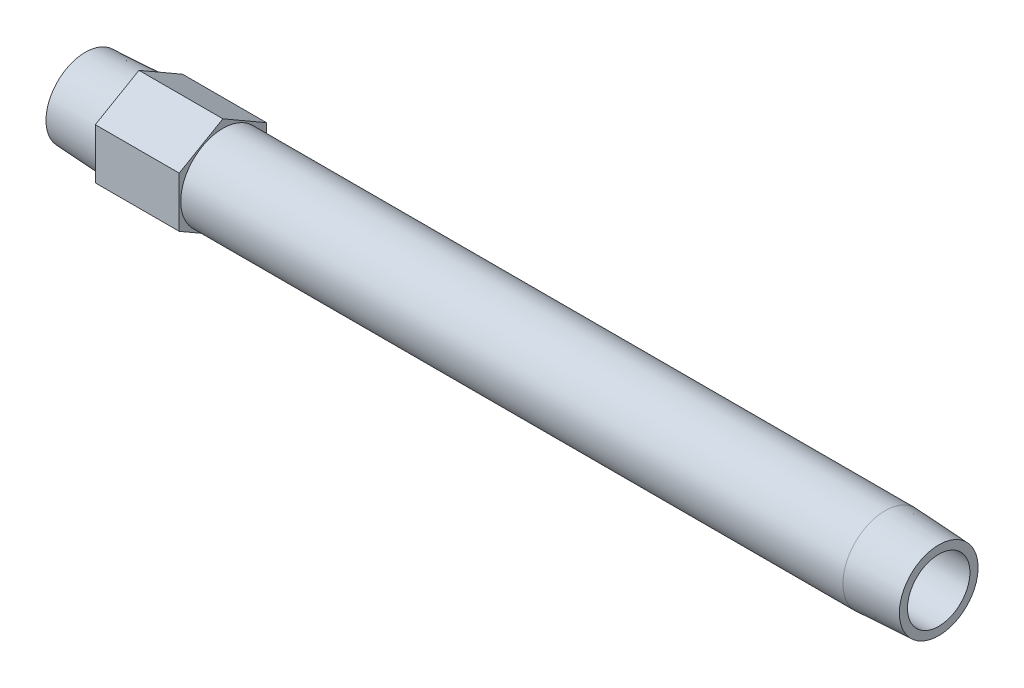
ISO-10303-21;
HEADER;
FILE_DESCRIPTION(('STEP AP214'),'2;1');
FILE_NAME('part.step','',(''),(''),'','','');
FILE_SCHEMA(('AUTOMOTIVE_DESIGN { 1 0 10303 214 1 1 1 1 }'));
ENDSEC;
DATA;
#1=APPLICATION_CONTEXT('core data for automotive mechanical design processes');
#2=APPLICATION_PROTOCOL_DEFINITION('international standard','automotive_design',2000,#1);
#3=PRODUCT_CONTEXT('',#1,'mechanical');
#4=PRODUCT('Part','Part','',(#3));
#5=PRODUCT_RELATED_PRODUCT_CATEGORY('part','',(#4));
#6=PRODUCT_DEFINITION_FORMATION('','',#4);
#7=PRODUCT_DEFINITION_CONTEXT('part definition',#1,'design');
#8=PRODUCT_DEFINITION('design','',#6,#7);
#9=PRODUCT_DEFINITION_SHAPE('','',#8);
#10=(LENGTH_UNIT() NAMED_UNIT(*) SI_UNIT(.MILLI.,.METRE.));
#11=(NAMED_UNIT(*) PLANE_ANGLE_UNIT() SI_UNIT($,.RADIAN.));
#12=(NAMED_UNIT(*) SI_UNIT($,.STERADIAN.) SOLID_ANGLE_UNIT());
#13=UNCERTAINTY_MEASURE_WITH_UNIT(LENGTH_MEASURE(1.E-05),#10,'distance_accuracy_value','');
#14=(GEOMETRIC_REPRESENTATION_CONTEXT(3) GLOBAL_UNCERTAINTY_ASSIGNED_CONTEXT((#13)) GLOBAL_UNIT_ASSIGNED_CONTEXT((#10,
#11,#12)) REPRESENTATION_CONTEXT('',''));
#15=CARTESIAN_POINT('',(0.,0.,0.));
#16=DIRECTION('',(0.,0.,1.));
#17=DIRECTION('',(1.,0.,0.));
#18=AXIS2_PLACEMENT_3D('',#15,#16,#17);
#19=CARTESIAN_POINT('',(0.,0.,-9.95716184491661));
#20=DIRECTION('',(1.,0.,0.));
#21=DIRECTION('',(0.,0.,-1.));
#22=AXIS2_PLACEMENT_3D('',#19,#20,#21);
#23=PLANE('',#22);
#24=CARTESIAN_POINT('',(0.,0.,0.));
#25=DIRECTION('',(-1.,0.,0.));
#26=DIRECTION('',(0.,0.,1.));
#27=AXIS2_PLACEMENT_3D('',#24,#25,#26);
#28=CIRCLE('',#27,9.95716184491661);
#29=CARTESIAN_POINT('',(0.,0.,9.95716184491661));
#30=VERTEX_POINT('',#29);
#31=EDGE_CURVE('E147',#30,#30,#28,.T.);
#32=ORIENTED_EDGE('',*,*,#31,.T.);
#33=EDGE_LOOP('',(#32));
#34=FACE_BOUND('',#33,.T.);
#35=CARTESIAN_POINT('',(0.,0.,0.));
#36=DIRECTION('',(1.,0.,0.));
#37=DIRECTION('',(0.,0.,1.));
#38=AXIS2_PLACEMENT_3D('',#35,#36,#37);
#39=CIRCLE('',#38,7.8994);
#40=CARTESIAN_POINT('',(0.,0.,7.8994));
#41=VERTEX_POINT('',#40);
#42=EDGE_CURVE('E159',#41,#41,#39,.T.);
#43=ORIENTED_EDGE('',*,*,#42,.T.);
#44=EDGE_LOOP('',(#43));
#45=FACE_BOUND('',#44,.T.);
#46=ADVANCED_FACE('F15',(#34,#45),#23,.F.);
#47=CARTESIAN_POINT('',(215.9,0.,-9.95716184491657));
#48=DIRECTION('',(-1.,0.,0.));
#49=DIRECTION('',(0.,0.,1.));
#50=AXIS2_PLACEMENT_3D('',#47,#48,#49);
#51=PLANE('',#50);
#52=CARTESIAN_POINT('',(215.9,0.,0.));
#53=DIRECTION('',(-1.,0.,0.));
#54=DIRECTION('',(0.,0.,1.));
#55=AXIS2_PLACEMENT_3D('',#52,#53,#54);
#56=CIRCLE('',#55,9.95716184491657);
#57=CARTESIAN_POINT('',(215.9,0.,9.95716184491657));
#58=VERTEX_POINT('',#57);
#59=EDGE_CURVE('E150',#58,#58,#56,.T.);
#60=ORIENTED_EDGE('',*,*,#59,.F.);
#61=EDGE_LOOP('',(#60));
#62=FACE_BOUND('',#61,.T.);
#63=CARTESIAN_POINT('',(215.9,0.,0.));
#64=DIRECTION('',(-1.,0.,0.));
#65=DIRECTION('',(0.,0.,1.));
#66=AXIS2_PLACEMENT_3D('',#63,#64,#65);
#67=CIRCLE('',#66,7.8994);
#68=CARTESIAN_POINT('',(215.9,0.,7.8994));
#69=VERTEX_POINT('',#68);
#70=EDGE_CURVE('E156',#69,#69,#67,.F.);
#71=ORIENTED_EDGE('',*,*,#70,.F.);
#72=EDGE_LOOP('',(#71));
#73=FACE_BOUND('',#72,.T.);
#74=ADVANCED_FACE('F178',(#62,#73),#51,.F.);
#75=CARTESIAN_POINT('',(34.798,-6.37914312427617,-11.049));
#76=DIRECTION('',(1.,0.,0.));
#77=DIRECTION('',(0.,1.,0.));
#78=AXIS2_PLACEMENT_3D('',#75,#76,#77);
#79=PLANE('',#78);
#80=DIRECTION('',(0.,0.5,-0.866025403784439));
#81=VECTOR('',#80,1.);
#82=CARTESIAN_POINT('',(34.798,-12.7582862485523,0.));
#83=LINE('',#82,#81);
#84=CARTESIAN_POINT('',(34.798,-12.7582862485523,0.));
#85=VERTEX_POINT('',#84);
#86=CARTESIAN_POINT('',(34.798,-6.37914312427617,-11.049));
#87=VERTEX_POINT('',#86);
#88=EDGE_CURVE('E103',#85,#87,#83,.T.);
#89=ORIENTED_EDGE('',*,*,#88,.T.);
#90=DIRECTION('',(0.,1.,0.));
#91=VECTOR('',#90,1.);
#92=CARTESIAN_POINT('',(34.798,-6.37914312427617,-11.049));
#93=LINE('',#92,#91);
#94=CARTESIAN_POINT('',(34.798,6.37914312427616,-11.049));
#95=VERTEX_POINT('',#94);
#96=EDGE_CURVE('E83',#87,#95,#93,.T.);
#97=ORIENTED_EDGE('',*,*,#96,.T.);
#98=DIRECTION('',(0.,0.5,0.866025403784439));
#99=VECTOR('',#98,1.);
#100=CARTESIAN_POINT('',(34.798,6.37914312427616,-11.049));
#101=LINE('',#100,#99);
#102=CARTESIAN_POINT('',(34.798,12.7582862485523,0.));
#103=VERTEX_POINT('',#102);
#104=EDGE_CURVE('E102',#95,#103,#101,.T.);
#105=ORIENTED_EDGE('',*,*,#104,.T.);
#106=DIRECTION('',(0.,-0.5,0.866025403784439));
#107=VECTOR('',#106,1.);
#108=CARTESIAN_POINT('',(34.798,12.7582862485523,0.));
#109=LINE('',#108,#107);
#110=CARTESIAN_POINT('',(34.798,6.37914312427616,11.049));
#111=VERTEX_POINT('',#110);
#112=EDGE_CURVE('E105',#103,#111,#109,.T.);
#113=ORIENTED_EDGE('',*,*,#112,.T.);
#114=DIRECTION('',(0.,-1.,0.));
#115=VECTOR('',#114,1.);
#116=CARTESIAN_POINT('',(34.798,6.37914312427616,11.049));
#117=LINE('',#116,#115);
#118=CARTESIAN_POINT('',(34.798,-6.37914312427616,11.049));
#119=VERTEX_POINT('',#118);
#120=EDGE_CURVE('E35',#111,#119,#117,.T.);
#121=ORIENTED_EDGE('',*,*,#120,.T.);
#122=DIRECTION('',(0.,-0.5,-0.866025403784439));
#123=VECTOR('',#122,1.);
#124=CARTESIAN_POINT('',(34.798,-6.37914312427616,11.049));
#125=LINE('',#124,#123);
#126=EDGE_CURVE('E30',#119,#85,#125,.T.);
#127=ORIENTED_EDGE('',*,*,#126,.T.);
#128=EDGE_LOOP('',(#89,#97,#105,#113,#121,#127));
#129=FACE_BOUND('',#128,.T.);
#130=CARTESIAN_POINT('',(34.798,0.,0.));
#131=DIRECTION('',(1.,0.,0.));
#132=DIRECTION('',(0.,1.,0.));
#133=AXIS2_PLACEMENT_3D('',#130,#131,#132);
#134=CIRCLE('',#133,10.668);
#135=CARTESIAN_POINT('',(34.798,10.668,0.));
#136=VERTEX_POINT('',#135);
#137=EDGE_CURVE('E89',#136,#136,#134,.F.);
#138=ORIENTED_EDGE('',*,*,#137,.T.);
#139=EDGE_LOOP('',(#138));
#140=FACE_BOUND('',#139,.T.);
#141=ADVANCED_FACE('F124',(#129,#140),#79,.T.);
#142=CARTESIAN_POINT('',(13.5636,-6.37914312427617,-11.049));
#143=DIRECTION('',(1.,0.,0.));
#144=DIRECTION('',(0.,1.,0.));
#145=AXIS2_PLACEMENT_3D('',#142,#143,#144);
#146=PLANE('',#145);
#147=DIRECTION('',(0.,0.5,-0.866025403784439));
#148=VECTOR('',#147,1.);
#149=CARTESIAN_POINT('',(13.5636,-12.7582862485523,0.));
#150=LINE('',#149,#148);
#151=CARTESIAN_POINT('',(13.5636,-12.7582862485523,0.));
#152=VERTEX_POINT('',#151);
#153=CARTESIAN_POINT('',(13.5636,-6.37914312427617,-11.049));
#154=VERTEX_POINT('',#153);
#155=EDGE_CURVE('E73',#152,#154,#150,.T.);
#156=ORIENTED_EDGE('',*,*,#155,.F.);
#157=DIRECTION('',(0.,-0.5,-0.866025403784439));
#158=VECTOR('',#157,1.);
#159=CARTESIAN_POINT('',(13.5636,-6.37914312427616,11.049));
#160=LINE('',#159,#158);
#161=CARTESIAN_POINT('',(13.5636,-6.37914312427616,11.049));
#162=VERTEX_POINT('',#161);
#163=EDGE_CURVE('E99',#162,#152,#160,.T.);
#164=ORIENTED_EDGE('',*,*,#163,.F.);
#165=DIRECTION('',(0.,-1.,0.));
#166=VECTOR('',#165,1.);
#167=CARTESIAN_POINT('',(13.5636,6.37914312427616,11.049));
#168=LINE('',#167,#166);
#169=CARTESIAN_POINT('',(13.5636,6.37914312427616,11.049));
#170=VERTEX_POINT('',#169);
#171=EDGE_CURVE('E133',#170,#162,#168,.T.);
#172=ORIENTED_EDGE('',*,*,#171,.F.);
#173=DIRECTION('',(0.,-0.5,0.866025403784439));
#174=VECTOR('',#173,1.);
#175=CARTESIAN_POINT('',(13.5636,12.7582862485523,0.));
#176=LINE('',#175,#174);
#177=CARTESIAN_POINT('',(13.5636,12.7582862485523,0.));
#178=VERTEX_POINT('',#177);
#179=EDGE_CURVE('E129',#178,#170,#176,.T.);
#180=ORIENTED_EDGE('',*,*,#179,.F.);
#181=DIRECTION('',(0.,0.5,0.866025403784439));
#182=VECTOR('',#181,1.);
#183=CARTESIAN_POINT('',(13.5636,6.37914312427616,-11.049));
#184=LINE('',#183,#182);
#185=CARTESIAN_POINT('',(13.5636,6.37914312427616,-11.049));
#186=VERTEX_POINT('',#185);
#187=EDGE_CURVE('E75',#186,#178,#184,.T.);
#188=ORIENTED_EDGE('',*,*,#187,.F.);
#189=DIRECTION('',(0.,1.,0.));
#190=VECTOR('',#189,1.);
#191=CARTESIAN_POINT('',(13.5636,-6.37914312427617,-11.049));
#192=LINE('',#191,#190);
#193=EDGE_CURVE('E68',#154,#186,#192,.T.);
#194=ORIENTED_EDGE('',*,*,#193,.F.);
#195=EDGE_LOOP('',(#156,#164,#172,#180,#188,#194));
#196=FACE_BOUND('',#195,.T.);
#197=CARTESIAN_POINT('',(13.5636,0.,0.));
#198=DIRECTION('',(-1.,0.,0.));
#199=DIRECTION('',(0.,0.,1.));
#200=AXIS2_PLACEMENT_3D('',#197,#198,#199);
#201=CIRCLE('',#200,10.668);
#202=CARTESIAN_POINT('',(13.5636,0.,10.668));
#203=VERTEX_POINT('',#202);
#204=EDGE_CURVE('E95',#203,#203,#201,.T.);
#205=ORIENTED_EDGE('',*,*,#204,.F.);
#206=EDGE_LOOP('',(#205));
#207=FACE_BOUND('',#206,.T.);
#208=ADVANCED_FACE('F69',(#196,#207),#146,.F.);
#209=CARTESIAN_POINT('',(34.798,-12.7582862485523,0.));
#210=DIRECTION('',(0.,0.866025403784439,0.5));
#211=DIRECTION('',(0.,-0.5,0.866025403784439));
#212=AXIS2_PLACEMENT_3D('',#209,#210,#211);
#213=PLANE('',#212);
#214=ORIENTED_EDGE('',*,*,#155,.T.);
#215=DIRECTION('',(-1.,0.,0.));
#216=VECTOR('',#215,1.);
#217=CARTESIAN_POINT('',(34.798,-6.37914312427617,-11.049));
#218=LINE('',#217,#216);
#219=EDGE_CURVE('E10',#87,#154,#218,.T.);
#220=ORIENTED_EDGE('',*,*,#219,.F.);
#221=ORIENTED_EDGE('',*,*,#88,.F.);
#222=DIRECTION('',(-1.,0.,0.));
#223=VECTOR('',#222,1.);
#224=CARTESIAN_POINT('',(34.798,-12.7582862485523,0.));
#225=LINE('',#224,#223);
#226=EDGE_CURVE('E87',#85,#152,#225,.T.);
#227=ORIENTED_EDGE('',*,*,#226,.T.);
#228=EDGE_LOOP('',(#214,#220,#221,#227));
#229=FACE_BOUND('',#228,.T.);
#230=ADVANCED_FACE('F17',(#229),#213,.F.);
#231=CARTESIAN_POINT('',(34.798,-6.37914312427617,-11.049));
#232=DIRECTION('',(0.,0.,1.));
#233=DIRECTION('',(1.,0.,0.));
#234=AXIS2_PLACEMENT_3D('',#231,#232,#233);
#235=PLANE('',#234);
#236=ORIENTED_EDGE('',*,*,#193,.T.);
#237=DIRECTION('',(-1.,0.,0.));
#238=VECTOR('',#237,1.);
#239=CARTESIAN_POINT('',(34.798,6.37914312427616,-11.049));
#240=LINE('',#239,#238);
#241=EDGE_CURVE('E23',#95,#186,#240,.T.);
#242=ORIENTED_EDGE('',*,*,#241,.F.);
#243=ORIENTED_EDGE('',*,*,#96,.F.);
#244=ORIENTED_EDGE('',*,*,#219,.T.);
#245=EDGE_LOOP('',(#236,#242,#243,#244));
#246=FACE_BOUND('',#245,.T.);
#247=ADVANCED_FACE('F82',(#246),#235,.F.);
#248=CARTESIAN_POINT('',(34.798,6.37914312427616,-11.049));
#249=DIRECTION('',(0.,-0.866025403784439,0.5));
#250=DIRECTION('',(0.,-0.5,-0.866025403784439));
#251=AXIS2_PLACEMENT_3D('',#248,#249,#250);
#252=PLANE('',#251);
#253=ORIENTED_EDGE('',*,*,#187,.T.);
#254=DIRECTION('',(-1.,0.,0.));
#255=VECTOR('',#254,1.);
#256=CARTESIAN_POINT('',(34.798,12.7582862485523,0.));
#257=LINE('',#256,#255);
#258=EDGE_CURVE('E117',#103,#178,#257,.T.);
#259=ORIENTED_EDGE('',*,*,#258,.F.);
#260=ORIENTED_EDGE('',*,*,#104,.F.);
#261=ORIENTED_EDGE('',*,*,#241,.T.);
#262=EDGE_LOOP('',(#253,#259,#260,#261));
#263=FACE_BOUND('',#262,.T.);
#264=ADVANCED_FACE('F121',(#263),#252,.F.);
#265=CARTESIAN_POINT('',(34.798,12.7582862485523,0.));
#266=DIRECTION('',(0.,-0.866025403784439,-0.5));
#267=DIRECTION('',(0.,0.5,-0.866025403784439));
#268=AXIS2_PLACEMENT_3D('',#265,#266,#267);
#269=PLANE('',#268);
#270=ORIENTED_EDGE('',*,*,#179,.T.);
#271=DIRECTION('',(-1.,0.,0.));
#272=VECTOR('',#271,1.);
#273=CARTESIAN_POINT('',(34.798,6.37914312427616,11.049));
#274=LINE('',#273,#272);
#275=EDGE_CURVE('E114',#111,#170,#274,.T.);
#276=ORIENTED_EDGE('',*,*,#275,.F.);
#277=ORIENTED_EDGE('',*,*,#112,.F.);
#278=ORIENTED_EDGE('',*,*,#258,.T.);
#279=EDGE_LOOP('',(#270,#276,#277,#278));
#280=FACE_BOUND('',#279,.T.);
#281=ADVANCED_FACE('F128',(#280),#269,.F.);
#282=CARTESIAN_POINT('',(34.798,6.37914312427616,11.049));
#283=DIRECTION('',(0.,0.,-1.));
#284=DIRECTION('',(-1.,0.,0.));
#285=AXIS2_PLACEMENT_3D('',#282,#283,#284);
#286=PLANE('',#285);
#287=ORIENTED_EDGE('',*,*,#171,.T.);
#288=DIRECTION('',(-1.,0.,0.));
#289=VECTOR('',#288,1.);
#290=CARTESIAN_POINT('',(34.798,-6.37914312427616,11.049));
#291=LINE('',#290,#289);
#292=EDGE_CURVE('E111',#119,#162,#291,.T.);
#293=ORIENTED_EDGE('',*,*,#292,.F.);
#294=ORIENTED_EDGE('',*,*,#120,.F.);
#295=ORIENTED_EDGE('',*,*,#275,.T.);
#296=EDGE_LOOP('',(#287,#293,#294,#295));
#297=FACE_BOUND('',#296,.T.);
#298=ADVANCED_FACE('F132',(#297),#286,.F.);
#299=CARTESIAN_POINT('',(34.798,-6.37914312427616,11.049));
#300=DIRECTION('',(0.,0.866025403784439,-0.5));
#301=DIRECTION('',(0.,0.5,0.866025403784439));
#302=AXIS2_PLACEMENT_3D('',#299,#300,#301);
#303=PLANE('',#302);
#304=ORIENTED_EDGE('',*,*,#163,.T.);
#305=ORIENTED_EDGE('',*,*,#226,.F.);
#306=ORIENTED_EDGE('',*,*,#126,.F.);
#307=ORIENTED_EDGE('',*,*,#292,.T.);
#308=EDGE_LOOP('',(#304,#305,#306,#307));
#309=FACE_BOUND('',#308,.T.);
#310=ADVANCED_FACE('F135',(#309),#303,.F.);
#311=CARTESIAN_POINT('',(13.5636,0.,0.));
#312=DIRECTION('',(1.,0.,0.));
#313=DIRECTION('',(0.,0.,-1.));
#314=AXIS2_PLACEMENT_3D('',#311,#312,#313);
#315=CONICAL_SURFACE('',#314,10.668,0.0523598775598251);
#316=ORIENTED_EDGE('',*,*,#31,.F.);
#317=EDGE_LOOP('',(#316));
#318=FACE_BOUND('',#317,.T.);
#319=ORIENTED_EDGE('',*,*,#204,.T.);
#320=EDGE_LOOP('',(#319));
#321=FACE_BOUND('',#320,.T.);
#322=ADVANCED_FACE('F187',(#318,#321),#315,.T.);
#323=CARTESIAN_POINT('',(-60.,0.,0.));
#324=DIRECTION('',(-1.,0.,0.));
#325=DIRECTION('',(0.,0.,1.));
#326=AXIS2_PLACEMENT_3D('',#323,#324,#325);
#327=CYLINDRICAL_SURFACE('',#326,10.668);
#328=ORIENTED_EDGE('',*,*,#137,.F.);
#329=EDGE_LOOP('',(#328));
#330=FACE_BOUND('',#329,.T.);
#331=CARTESIAN_POINT('',(202.3364,0.,0.));
#332=DIRECTION('',(-1.,0.,0.));
#333=DIRECTION('',(0.,0.,1.));
#334=AXIS2_PLACEMENT_3D('',#331,#332,#333);
#335=CIRCLE('',#334,10.668);
#336=CARTESIAN_POINT('',(202.3364,0.,10.668));
#337=VERTEX_POINT('',#336);
#338=EDGE_CURVE('E153',#337,#337,#335,.T.);
#339=ORIENTED_EDGE('',*,*,#338,.T.);
#340=EDGE_LOOP('',(#339));
#341=FACE_BOUND('',#340,.T.);
#342=ADVANCED_FACE('F174',(#330,#341),#327,.T.);
#343=CARTESIAN_POINT('',(215.9,0.,0.));
#344=DIRECTION('',(-1.,0.,0.));
#345=DIRECTION('',(0.,0.,1.));
#346=AXIS2_PLACEMENT_3D('',#343,#344,#345);
#347=CONICAL_SURFACE('',#346,9.95716184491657,0.052359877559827);
#348=ORIENTED_EDGE('',*,*,#338,.F.);
#349=EDGE_LOOP('',(#348));
#350=FACE_BOUND('',#349,.T.);
#351=ORIENTED_EDGE('',*,*,#59,.T.);
#352=EDGE_LOOP('',(#351));
#353=FACE_BOUND('',#352,.T.);
#354=ADVANCED_FACE('F167',(#350,#353),#347,.T.);
#355=CARTESIAN_POINT('',(218.522829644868,0.,0.));
#356=DIRECTION('',(-1.,0.,0.));
#357=DIRECTION('',(0.,0.,1.));
#358=AXIS2_PLACEMENT_3D('',#355,#356,#357);
#359=CYLINDRICAL_SURFACE('',#358,7.8994);
#360=ORIENTED_EDGE('',*,*,#70,.T.);
#361=EDGE_LOOP('',(#360));
#362=FACE_BOUND('',#361,.T.);
#363=ORIENTED_EDGE('',*,*,#42,.F.);
#364=EDGE_LOOP('',(#363));
#365=FACE_BOUND('',#364,.T.);
#366=ADVANCED_FACE('F165',(#362,#365),#359,.F.);
#367=CLOSED_SHELL('',(#46,#74,#141,#208,#230,#247,#264,#281,#298,#310,#322,#342,#354,#366));
#368=MANIFOLD_SOLID_BREP('B1',#367);
#369=ADVANCED_BREP_SHAPE_REPRESENTATION('',(#18,#368),#14);
#370=SHAPE_DEFINITION_REPRESENTATION(#9,#369);
ENDSEC;
END-ISO-10303-21;
